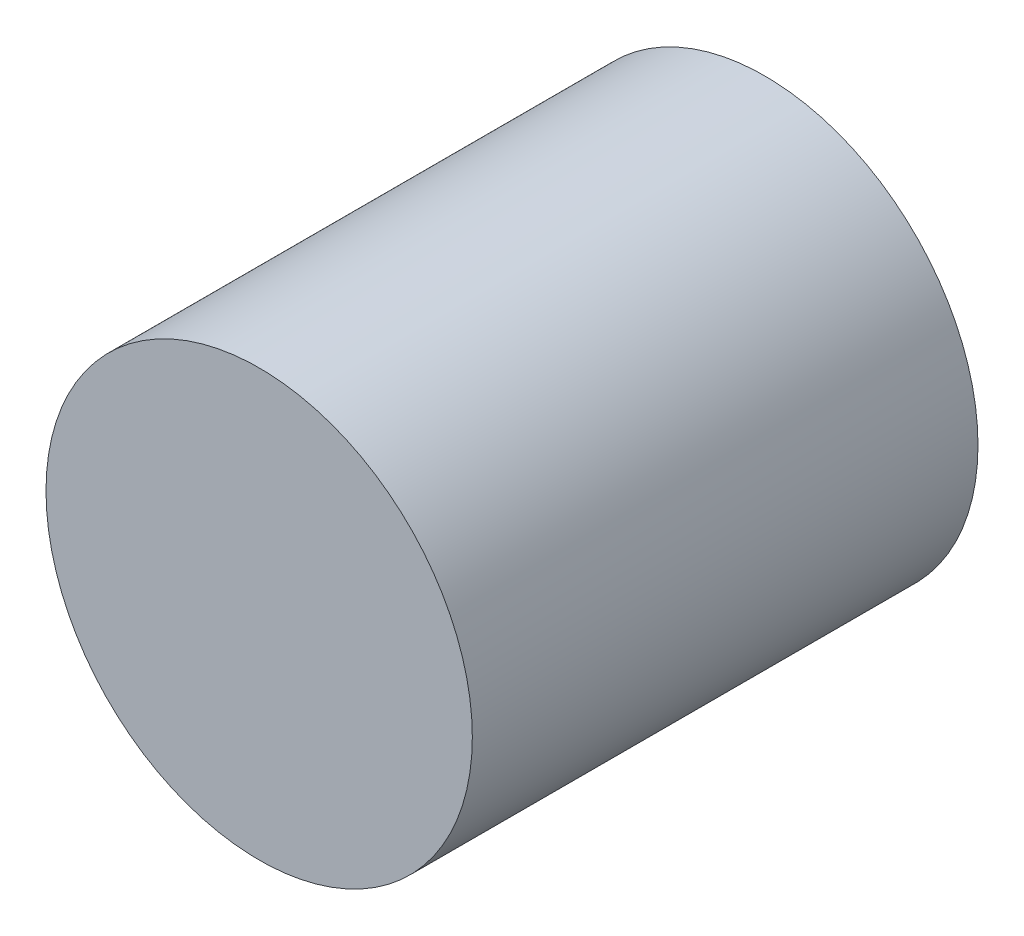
ISO-10303-21;
HEADER;
FILE_DESCRIPTION(('STEP AP214'),'2;1');
FILE_NAME('part.step','',(''),(''),'','','');
FILE_SCHEMA(('AUTOMOTIVE_DESIGN { 1 0 10303 214 1 1 1 1 }'));
ENDSEC;
DATA;
#1=APPLICATION_CONTEXT('core data for automotive mechanical design processes');
#2=APPLICATION_PROTOCOL_DEFINITION('international standard','automotive_design',2000,#1);
#3=PRODUCT_CONTEXT('',#1,'mechanical');
#4=PRODUCT('Part','Part','',(#3));
#5=PRODUCT_RELATED_PRODUCT_CATEGORY('part','',(#4));
#6=PRODUCT_DEFINITION_FORMATION('','',#4);
#7=PRODUCT_DEFINITION_CONTEXT('part definition',#1,'design');
#8=PRODUCT_DEFINITION('design','',#6,#7);
#9=PRODUCT_DEFINITION_SHAPE('','',#8);
#10=(LENGTH_UNIT() NAMED_UNIT(*) SI_UNIT(.MILLI.,.METRE.));
#11=(NAMED_UNIT(*) PLANE_ANGLE_UNIT() SI_UNIT($,.RADIAN.));
#12=(NAMED_UNIT(*) SI_UNIT($,.STERADIAN.) SOLID_ANGLE_UNIT());
#13=UNCERTAINTY_MEASURE_WITH_UNIT(LENGTH_MEASURE(1.E-05),#10,'distance_accuracy_value','');
#14=(GEOMETRIC_REPRESENTATION_CONTEXT(3) GLOBAL_UNCERTAINTY_ASSIGNED_CONTEXT((#13)) GLOBAL_UNIT_ASSIGNED_CONTEXT((#10,
#11,#12)) REPRESENTATION_CONTEXT('',''));
#15=CARTESIAN_POINT('',(0.,0.,0.));
#16=DIRECTION('',(0.,0.,1.));
#17=DIRECTION('',(1.,0.,0.));
#18=AXIS2_PLACEMENT_3D('',#15,#16,#17);
#19=CARTESIAN_POINT('',(0.,0.,51.));
#20=DIRECTION('',(0.,0.,-1.));
#21=DIRECTION('',(-1.,0.,0.));
#22=AXIS2_PLACEMENT_3D('',#19,#20,#21);
#23=CYLINDRICAL_SURFACE('',#22,21.5);
#24=CARTESIAN_POINT('',(0.,0.,51.));
#25=DIRECTION('',(0.,0.,1.));
#26=DIRECTION('',(1.,0.,0.));
#27=AXIS2_PLACEMENT_3D('',#24,#25,#26);
#28=CIRCLE('',#27,21.5);
#29=CARTESIAN_POINT('',(21.5,0.,51.));
#30=VERTEX_POINT('',#29);
#31=EDGE_CURVE('E10',#30,#30,#28,.T.);
#32=ORIENTED_EDGE('',*,*,#31,.F.);
#33=EDGE_LOOP('',(#32));
#34=FACE_BOUND('',#33,.T.);
#35=CARTESIAN_POINT('',(0.,0.,0.));
#36=DIRECTION('',(0.,0.,1.));
#37=DIRECTION('',(1.,0.,0.));
#38=AXIS2_PLACEMENT_3D('',#35,#36,#37);
#39=CIRCLE('',#38,21.5);
#40=CARTESIAN_POINT('',(21.5,0.,0.));
#41=VERTEX_POINT('',#40);
#42=EDGE_CURVE('E44',#41,#41,#39,.T.);
#43=ORIENTED_EDGE('',*,*,#42,.T.);
#44=EDGE_LOOP('',(#43));
#45=FACE_BOUND('',#44,.T.);
#46=ADVANCED_FACE('F41',(#34,#45),#23,.T.);
#47=CARTESIAN_POINT('',(0.,0.,51.));
#48=DIRECTION('',(0.,0.,1.));
#49=DIRECTION('',(1.,0.,0.));
#50=AXIS2_PLACEMENT_3D('',#47,#48,#49);
#51=PLANE('',#50);
#52=ORIENTED_EDGE('',*,*,#31,.T.);
#53=EDGE_LOOP('',(#52));
#54=FACE_BOUND('',#53,.T.);
#55=ADVANCED_FACE('F60',(#54),#51,.T.);
#56=CARTESIAN_POINT('',(0.,0.,0.));
#57=DIRECTION('',(0.,0.,1.));
#58=DIRECTION('',(1.,0.,0.));
#59=AXIS2_PLACEMENT_3D('',#56,#57,#58);
#60=PLANE('',#59);
#61=ORIENTED_EDGE('',*,*,#42,.F.);
#62=EDGE_LOOP('',(#61));
#63=FACE_BOUND('',#62,.T.);
#64=ADVANCED_FACE('F58',(#63),#60,.F.);
#65=CLOSED_SHELL('',(#46,#55,#64));
#66=MANIFOLD_SOLID_BREP('B2',#65);
#67=ADVANCED_BREP_SHAPE_REPRESENTATION('',(#18,#66),#14);
#68=SHAPE_DEFINITION_REPRESENTATION(#9,#67);
ENDSEC;
END-ISO-10303-21;
